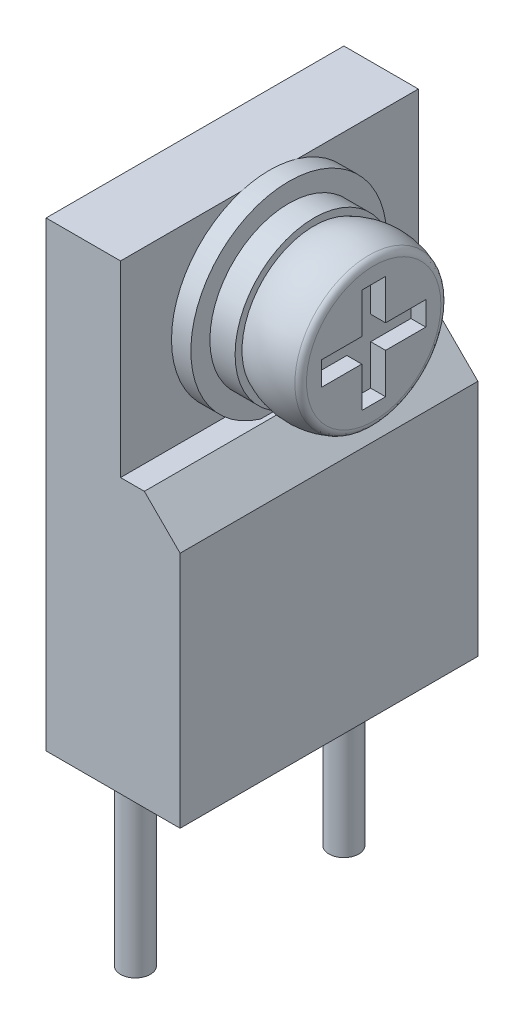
ISO-10303-21;
HEADER;
FILE_DESCRIPTION(('STEP AP214'),'2;1');
FILE_NAME('part.step','',(''),(''),'','','');
FILE_SCHEMA(('AUTOMOTIVE_DESIGN { 1 0 10303 214 1 1 1 1 }'));
ENDSEC;
DATA;
#1=APPLICATION_CONTEXT('core data for automotive mechanical design processes');
#2=APPLICATION_PROTOCOL_DEFINITION('international standard','automotive_design',2000,#1);
#3=PRODUCT_CONTEXT('',#1,'mechanical');
#4=PRODUCT('Part','Part','',(#3));
#5=PRODUCT_RELATED_PRODUCT_CATEGORY('part','',(#4));
#6=PRODUCT_DEFINITION_FORMATION('','',#4);
#7=PRODUCT_DEFINITION_CONTEXT('part definition',#1,'design');
#8=PRODUCT_DEFINITION('design','',#6,#7);
#9=PRODUCT_DEFINITION_SHAPE('','',#8);
#10=(LENGTH_UNIT() NAMED_UNIT(*) SI_UNIT(.MILLI.,.METRE.));
#11=(NAMED_UNIT(*) PLANE_ANGLE_UNIT() SI_UNIT($,.RADIAN.));
#12=(NAMED_UNIT(*) SI_UNIT($,.STERADIAN.) SOLID_ANGLE_UNIT());
#13=UNCERTAINTY_MEASURE_WITH_UNIT(LENGTH_MEASURE(1.E-05),#10,'distance_accuracy_value','');
#14=(GEOMETRIC_REPRESENTATION_CONTEXT(3) GLOBAL_UNCERTAINTY_ASSIGNED_CONTEXT((#13)) GLOBAL_UNIT_ASSIGNED_CONTEXT((#10,
#11,#12)) REPRESENTATION_CONTEXT('',''));
#15=CARTESIAN_POINT('',(0.,0.,0.));
#16=DIRECTION('',(0.,0.,1.));
#17=DIRECTION('',(1.,0.,0.));
#18=AXIS2_PLACEMENT_3D('',#15,#16,#17);
#19=CARTESIAN_POINT('',(1.5,-6.25,-3.5));
#20=DIRECTION('',(0.,1.,0.));
#21=DIRECTION('',(-1.,0.,0.));
#22=AXIS2_PLACEMENT_3D('',#19,#20,#21);
#23=CYLINDRICAL_SURFACE('',#22,0.5);
#24=CARTESIAN_POINT('',(1.5,0.,-3.5));
#25=DIRECTION('',(0.,-1.,0.));
#26=DIRECTION('',(-1.,0.,0.));
#27=AXIS2_PLACEMENT_3D('',#24,#25,#26);
#28=CIRCLE('',#27,0.5);
#29=CARTESIAN_POINT('',(1.,0.,-3.5));
#30=VERTEX_POINT('',#29);
#31=EDGE_CURVE('E11',#30,#30,#28,.T.);
#32=ORIENTED_EDGE('',*,*,#31,.T.);
#33=EDGE_LOOP('',(#32));
#34=FACE_BOUND('',#33,.T.);
#35=CARTESIAN_POINT('',(1.5,-6.25,-3.5));
#36=DIRECTION('',(0.,-1.,0.));
#37=DIRECTION('',(-1.,0.,0.));
#38=AXIS2_PLACEMENT_3D('',#35,#36,#37);
#39=CIRCLE('',#38,0.5);
#40=CARTESIAN_POINT('',(1.,-6.25,-3.5));
#41=VERTEX_POINT('',#40);
#42=EDGE_CURVE('E375',#41,#41,#39,.T.);
#43=ORIENTED_EDGE('',*,*,#42,.F.);
#44=EDGE_LOOP('',(#43));
#45=FACE_BOUND('',#44,.T.);
#46=ADVANCED_FACE('F17',(#34,#45),#23,.T.);
#47=CARTESIAN_POINT('',(1.5,-6.25,3.5));
#48=DIRECTION('',(0.,1.,0.));
#49=DIRECTION('',(-1.,0.,0.));
#50=AXIS2_PLACEMENT_3D('',#47,#48,#49);
#51=CYLINDRICAL_SURFACE('',#50,0.5);
#52=CARTESIAN_POINT('',(1.5,0.,3.5));
#53=DIRECTION('',(0.,-1.,0.));
#54=DIRECTION('',(1.,0.,0.));
#55=AXIS2_PLACEMENT_3D('',#52,#53,#54);
#56=CIRCLE('',#55,0.5);
#57=CARTESIAN_POINT('',(2.,0.,3.5));
#58=VERTEX_POINT('',#57);
#59=EDGE_CURVE('E27',#58,#58,#56,.T.);
#60=ORIENTED_EDGE('',*,*,#59,.T.);
#61=EDGE_LOOP('',(#60));
#62=FACE_BOUND('',#61,.T.);
#63=CARTESIAN_POINT('',(1.5,-6.25,3.5));
#64=DIRECTION('',(0.,-1.,0.));
#65=DIRECTION('',(1.,0.,0.));
#66=AXIS2_PLACEMENT_3D('',#63,#64,#65);
#67=CIRCLE('',#66,0.5);
#68=CARTESIAN_POINT('',(2.,-6.25,3.5));
#69=VERTEX_POINT('',#68);
#70=EDGE_CURVE('E202',#69,#69,#67,.T.);
#71=ORIENTED_EDGE('',*,*,#70,.F.);
#72=EDGE_LOOP('',(#71));
#73=FACE_BOUND('',#72,.T.);
#74=ADVANCED_FACE('F382',(#62,#73),#51,.T.);
#75=CARTESIAN_POINT('',(2.5,12.35,0.));
#76=DIRECTION('',(1.,0.,0.));
#77=DIRECTION('',(0.,0.,-1.));
#78=AXIS2_PLACEMENT_3D('',#75,#76,#77);
#79=CYLINDRICAL_SURFACE('',#78,3.28896076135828);
#80=CARTESIAN_POINT('',(2.5,12.35,0.));
#81=DIRECTION('',(1.,0.,0.));
#82=DIRECTION('',(0.,0.,-1.));
#83=AXIS2_PLACEMENT_3D('',#80,#81,#82);
#84=CIRCLE('',#83,3.28896076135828);
#85=CARTESIAN_POINT('',(2.5,15.5,0.94591907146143));
#86=VERTEX_POINT('',#85);
#87=CARTESIAN_POINT('',(2.5,9.2,0.94591907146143));
#88=VERTEX_POINT('',#87);
#89=EDGE_CURVE('E369',#86,#88,#84,.T.);
#90=ORIENTED_EDGE('',*,*,#89,.T.);
#91=DIRECTION('',(1.,0.,0.));
#92=VECTOR('',#91,1.);
#93=CARTESIAN_POINT('',(2.5,9.2,0.94591907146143));
#94=LINE('',#93,#92);
#95=CARTESIAN_POINT('',(3.15,9.2,0.94591907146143));
#96=VERTEX_POINT('',#95);
#97=EDGE_CURVE('E293',#88,#96,#94,.T.);
#98=ORIENTED_EDGE('',*,*,#97,.T.);
#99=CARTESIAN_POINT('',(3.15,12.35,0.));
#100=DIRECTION('',(1.,0.,0.));
#101=DIRECTION('',(0.,0.,-1.));
#102=AXIS2_PLACEMENT_3D('',#99,#100,#101);
#103=CIRCLE('',#102,3.28896076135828);
#104=CARTESIAN_POINT('',(3.15,9.2,-0.94591907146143));
#105=VERTEX_POINT('',#104);
#106=EDGE_CURVE('E292',#105,#96,#103,.T.);
#107=ORIENTED_EDGE('',*,*,#106,.F.);
#108=DIRECTION('',(-1.,0.,0.));
#109=VECTOR('',#108,1.);
#110=CARTESIAN_POINT('',(2.5,9.2,-0.94591907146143));
#111=LINE('',#110,#109);
#112=CARTESIAN_POINT('',(2.5,9.2,-0.94591907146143));
#113=VERTEX_POINT('',#112);
#114=EDGE_CURVE('E360',#105,#113,#111,.T.);
#115=ORIENTED_EDGE('',*,*,#114,.T.);
#116=CARTESIAN_POINT('',(2.5,12.35,0.));
#117=DIRECTION('',(1.,0.,0.));
#118=DIRECTION('',(0.,0.,-1.));
#119=AXIS2_PLACEMENT_3D('',#116,#117,#118);
#120=CIRCLE('',#119,3.28896076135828);
#121=CARTESIAN_POINT('',(2.5,15.5,-0.94591907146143));
#122=VERTEX_POINT('',#121);
#123=EDGE_CURVE('E366',#113,#122,#120,.T.);
#124=ORIENTED_EDGE('',*,*,#123,.T.);
#125=CARTESIAN_POINT('',(2.5,12.35,0.));
#126=DIRECTION('',(1.,0.,0.));
#127=DIRECTION('',(0.,0.,-1.));
#128=AXIS2_PLACEMENT_3D('',#125,#126,#127);
#129=CIRCLE('',#128,3.28896076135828);
#130=EDGE_CURVE('E363',#122,#86,#129,.T.);
#131=ORIENTED_EDGE('',*,*,#130,.T.);
#132=EDGE_LOOP('',(#90,#98,#107,#115,#124,#131));
#133=FACE_BOUND('',#132,.T.);
#134=ADVANCED_FACE('F389',(#133),#79,.T.);
#135=CARTESIAN_POINT('',(2.5,12.35,0.));
#136=DIRECTION('',(1.,0.,0.));
#137=DIRECTION('',(0.,0.,-1.));
#138=AXIS2_PLACEMENT_3D('',#135,#136,#137);
#139=CYLINDRICAL_SURFACE('',#138,2.65);
#140=CARTESIAN_POINT('',(3.99611740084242,12.35,0.));
#141=DIRECTION('',(1.,0.,0.));
#142=DIRECTION('',(0.,0.,-1.));
#143=AXIS2_PLACEMENT_3D('',#140,#141,#142);
#144=CIRCLE('',#143,2.65);
#145=CARTESIAN_POINT('',(3.99611740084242,12.35,-2.65));
#146=VERTEX_POINT('',#145);
#147=EDGE_CURVE('E349',#146,#146,#144,.T.);
#148=ORIENTED_EDGE('',*,*,#147,.F.);
#149=EDGE_LOOP('',(#148));
#150=FACE_BOUND('',#149,.T.);
#151=CARTESIAN_POINT('',(3.15,12.35,0.));
#152=DIRECTION('',(1.,0.,0.));
#153=DIRECTION('',(0.,0.,-1.));
#154=AXIS2_PLACEMENT_3D('',#151,#152,#153);
#155=CIRCLE('',#154,2.65);
#156=CARTESIAN_POINT('',(3.15,12.35,-2.65));
#157=VERTEX_POINT('',#156);
#158=EDGE_CURVE('E355',#157,#157,#155,.T.);
#159=ORIENTED_EDGE('',*,*,#158,.T.);
#160=EDGE_LOOP('',(#159));
#161=FACE_BOUND('',#160,.T.);
#162=ADVANCED_FACE('F395',(#150,#161),#139,.T.);
#163=CARTESIAN_POINT('',(5.,12.35,0.));
#164=DIRECTION('',(1.,0.,0.));
#165=DIRECTION('',(0.,0.,-1.));
#166=AXIS2_PLACEMENT_3D('',#163,#164,#165);
#167=DEGENERATE_TOROIDAL_SURFACE('',#166,0.363402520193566,2.28659747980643,.T.);
#168=CARTESIAN_POINT('',(5.84206532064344,12.35,0.));
#169=DIRECTION('',(1.,0.,0.));
#170=DIRECTION('',(0.,0.,-1.));
#171=AXIS2_PLACEMENT_3D('',#168,#169,#170);
#172=CIRCLE('',#171,2.48930327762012);
#173=CARTESIAN_POINT('',(5.84206532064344,12.35,-2.48930327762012));
#174=VERTEX_POINT('',#173);
#175=EDGE_CURVE('E343',#174,#174,#172,.T.);
#176=ORIENTED_EDGE('',*,*,#175,.F.);
#177=EDGE_LOOP('',(#176));
#178=FACE_BOUND('',#177,.T.);
#179=CARTESIAN_POINT('',(3.99611740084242,12.35,0.));
#180=DIRECTION('',(1.,0.,0.));
#181=DIRECTION('',(0.,0.,-1.));
#182=AXIS2_PLACEMENT_3D('',#179,#180,#181);
#183=CIRCLE('',#182,2.41784837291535);
#184=CARTESIAN_POINT('',(3.99611740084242,12.35,-2.41784837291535));
#185=VERTEX_POINT('',#184);
#186=EDGE_CURVE('E352',#185,#185,#183,.T.);
#187=ORIENTED_EDGE('',*,*,#186,.T.);
#188=EDGE_LOOP('',(#187));
#189=FACE_BOUND('',#188,.T.);
#190=ADVANCED_FACE('F399',(#178,#189),#167,.T.);
#191=CARTESIAN_POINT('',(5.75,12.35,0.));
#192=DIRECTION('',(1.,0.,0.));
#193=DIRECTION('',(0.,0.,-1.));
#194=AXIS2_PLACEMENT_3D('',#191,#192,#193);
#195=TOROIDAL_SURFACE('',#194,2.25687269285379,0.250000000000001);
#196=CARTESIAN_POINT('',(6.,12.35,0.));
#197=DIRECTION('',(1.,0.,0.));
#198=DIRECTION('',(0.,0.,-1.));
#199=AXIS2_PLACEMENT_3D('',#196,#197,#198);
#200=CIRCLE('',#199,2.25687269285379);
#201=CARTESIAN_POINT('',(6.,12.35,-2.25687269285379));
#202=VERTEX_POINT('',#201);
#203=EDGE_CURVE('E331',#202,#202,#200,.T.);
#204=ORIENTED_EDGE('',*,*,#203,.F.);
#205=EDGE_LOOP('',(#204));
#206=FACE_BOUND('',#205,.T.);
#207=ORIENTED_EDGE('',*,*,#175,.T.);
#208=EDGE_LOOP('',(#207));
#209=FACE_BOUND('',#208,.T.);
#210=ADVANCED_FACE('F403',(#206,#209),#195,.T.);
#211=CARTESIAN_POINT('',(4.5,0.,-5.));
#212=DIRECTION('',(0.,-1.,0.));
#213=DIRECTION('',(1.,0.,0.));
#214=AXIS2_PLACEMENT_3D('',#211,#212,#213);
#215=PLANE('',#214);
#216=ORIENTED_EDGE('',*,*,#59,.F.);
#217=EDGE_LOOP('',(#216));
#218=FACE_BOUND('',#217,.T.);
#219=DIRECTION('',(1.,0.,0.));
#220=VECTOR('',#219,1.);
#221=CARTESIAN_POINT('',(4.5,0.,5.));
#222=LINE('',#221,#220);
#223=CARTESIAN_POINT('',(0.,0.,5.));
#224=VERTEX_POINT('',#223);
#225=CARTESIAN_POINT('',(4.5,0.,5.));
#226=VERTEX_POINT('',#225);
#227=EDGE_CURVE('E278',#224,#226,#222,.T.);
#228=ORIENTED_EDGE('',*,*,#227,.F.);
#229=DIRECTION('',(0.,0.,1.));
#230=VECTOR('',#229,1.);
#231=CARTESIAN_POINT('',(0.,0.,-5.));
#232=LINE('',#231,#230);
#233=CARTESIAN_POINT('',(0.,0.,-5.));
#234=VERTEX_POINT('',#233);
#235=EDGE_CURVE('E315',#234,#224,#232,.T.);
#236=ORIENTED_EDGE('',*,*,#235,.F.);
#237=DIRECTION('',(1.,0.,0.));
#238=VECTOR('',#237,1.);
#239=CARTESIAN_POINT('',(4.5,0.,-5.));
#240=LINE('',#239,#238);
#241=CARTESIAN_POINT('',(4.5,0.,-5.));
#242=VERTEX_POINT('',#241);
#243=EDGE_CURVE('E340',#234,#242,#240,.T.);
#244=ORIENTED_EDGE('',*,*,#243,.T.);
#245=DIRECTION('',(0.,0.,1.));
#246=VECTOR('',#245,1.);
#247=CARTESIAN_POINT('',(4.5,0.,-5.));
#248=LINE('',#247,#246);
#249=EDGE_CURVE('E337',#242,#226,#248,.T.);
#250=ORIENTED_EDGE('',*,*,#249,.T.);
#251=EDGE_LOOP('',(#228,#236,#244,#250));
#252=FACE_BOUND('',#251,.T.);
#253=ORIENTED_EDGE('',*,*,#31,.F.);
#254=EDGE_LOOP('',(#253));
#255=FACE_BOUND('',#254,.T.);
#256=ADVANCED_FACE('F407',(#218,#252,#255),#215,.T.);
#257=CARTESIAN_POINT('',(2.5,15.5,-5.));
#258=DIRECTION('',(1.,0.,0.));
#259=DIRECTION('',(0.,1.,0.));
#260=AXIS2_PLACEMENT_3D('',#257,#258,#259);
#261=PLANE('',#260);
#262=ORIENTED_EDGE('',*,*,#89,.F.);
#263=DIRECTION('',(0.,0.,1.));
#264=VECTOR('',#263,1.);
#265=CARTESIAN_POINT('',(2.5,15.5,-5.));
#266=LINE('',#265,#264);
#267=CARTESIAN_POINT('',(2.5,15.5,5.));
#268=VERTEX_POINT('',#267);
#269=EDGE_CURVE('E326',#86,#268,#266,.T.);
#270=ORIENTED_EDGE('',*,*,#269,.T.);
#271=DIRECTION('',(0.,1.,0.));
#272=VECTOR('',#271,1.);
#273=CARTESIAN_POINT('',(2.5,15.5,5.));
#274=LINE('',#273,#272);
#275=CARTESIAN_POINT('',(2.5,9.2,5.));
#276=VERTEX_POINT('',#275);
#277=EDGE_CURVE('E302',#276,#268,#274,.T.);
#278=ORIENTED_EDGE('',*,*,#277,.F.);
#279=DIRECTION('',(0.,0.,1.));
#280=VECTOR('',#279,1.);
#281=CARTESIAN_POINT('',(2.5,9.2,-5.));
#282=LINE('',#281,#280);
#283=EDGE_CURVE('E297',#88,#276,#282,.T.);
#284=ORIENTED_EDGE('',*,*,#283,.F.);
#285=EDGE_LOOP('',(#262,#270,#278,#284));
#286=FACE_BOUND('',#285,.T.);
#287=ADVANCED_FACE('F411',(#286),#261,.T.);
#288=CARTESIAN_POINT('',(0.,0.,-5.));
#289=DIRECTION('',(-1.,0.,0.));
#290=DIRECTION('',(0.,0.,1.));
#291=AXIS2_PLACEMENT_3D('',#288,#289,#290);
#292=PLANE('',#291);
#293=DIRECTION('',(0.,-1.,0.));
#294=VECTOR('',#293,1.);
#295=CARTESIAN_POINT('',(0.,0.,5.));
#296=LINE('',#295,#294);
#297=CARTESIAN_POINT('',(0.,15.5,5.));
#298=VERTEX_POINT('',#297);
#299=EDGE_CURVE('E322',#298,#224,#296,.T.);
#300=ORIENTED_EDGE('',*,*,#299,.F.);
#301=DIRECTION('',(0.,0.,1.));
#302=VECTOR('',#301,1.);
#303=CARTESIAN_POINT('',(0.,15.5,-5.));
#304=LINE('',#303,#302);
#305=CARTESIAN_POINT('',(0.,15.5,-5.));
#306=VERTEX_POINT('',#305);
#307=EDGE_CURVE('E308',#306,#298,#304,.T.);
#308=ORIENTED_EDGE('',*,*,#307,.F.);
#309=DIRECTION('',(0.,-1.,0.));
#310=VECTOR('',#309,1.);
#311=CARTESIAN_POINT('',(0.,0.,-5.));
#312=LINE('',#311,#310);
#313=EDGE_CURVE('E323',#306,#234,#312,.T.);
#314=ORIENTED_EDGE('',*,*,#313,.T.);
#315=ORIENTED_EDGE('',*,*,#235,.T.);
#316=EDGE_LOOP('',(#300,#308,#314,#315));
#317=FACE_BOUND('',#316,.T.);
#318=ADVANCED_FACE('F415',(#317),#292,.T.);
#319=CARTESIAN_POINT('',(0.,15.5,-5.));
#320=DIRECTION('',(0.,1.,0.));
#321=DIRECTION('',(0.,0.,1.));
#322=AXIS2_PLACEMENT_3D('',#319,#320,#321);
#323=PLANE('',#322);
#324=DIRECTION('',(-1.,0.,0.));
#325=VECTOR('',#324,1.);
#326=CARTESIAN_POINT('',(0.,15.5,5.));
#327=LINE('',#326,#325);
#328=EDGE_CURVE('E319',#268,#298,#327,.T.);
#329=ORIENTED_EDGE('',*,*,#328,.F.);
#330=ORIENTED_EDGE('',*,*,#269,.F.);
#331=DIRECTION('',(0.,0.,1.));
#332=VECTOR('',#331,1.);
#333=CARTESIAN_POINT('',(2.5,15.5,-5.));
#334=LINE('',#333,#332);
#335=EDGE_CURVE('E36',#122,#86,#334,.T.);
#336=ORIENTED_EDGE('',*,*,#335,.F.);
#337=DIRECTION('',(0.,0.,1.));
#338=VECTOR('',#337,1.);
#339=CARTESIAN_POINT('',(2.5,15.5,-5.));
#340=LINE('',#339,#338);
#341=CARTESIAN_POINT('',(2.5,15.5,-5.));
#342=VERTEX_POINT('',#341);
#343=EDGE_CURVE('E309',#342,#122,#340,.T.);
#344=ORIENTED_EDGE('',*,*,#343,.F.);
#345=DIRECTION('',(-1.,0.,0.));
#346=VECTOR('',#345,1.);
#347=CARTESIAN_POINT('',(0.,15.5,-5.));
#348=LINE('',#347,#346);
#349=EDGE_CURVE('E312',#342,#306,#348,.T.);
#350=ORIENTED_EDGE('',*,*,#349,.T.);
#351=ORIENTED_EDGE('',*,*,#307,.T.);
#352=EDGE_LOOP('',(#329,#330,#336,#344,#350,#351));
#353=FACE_BOUND('',#352,.T.);
#354=ADVANCED_FACE('F419',(#353),#323,.T.);
#355=CARTESIAN_POINT('',(2.5,15.5,-5.));
#356=DIRECTION('',(1.,0.,0.));
#357=DIRECTION('',(0.,1.,0.));
#358=AXIS2_PLACEMENT_3D('',#355,#356,#357);
#359=PLANE('',#358);
#360=ORIENTED_EDGE('',*,*,#123,.F.);
#361=DIRECTION('',(0.,0.,1.));
#362=VECTOR('',#361,1.);
#363=CARTESIAN_POINT('',(2.5,9.2,-5.));
#364=LINE('',#363,#362);
#365=CARTESIAN_POINT('',(2.5,9.2,-5.));
#366=VERTEX_POINT('',#365);
#367=EDGE_CURVE('E283',#366,#113,#364,.T.);
#368=ORIENTED_EDGE('',*,*,#367,.F.);
#369=DIRECTION('',(0.,1.,0.));
#370=VECTOR('',#369,1.);
#371=CARTESIAN_POINT('',(2.5,15.5,-5.));
#372=LINE('',#371,#370);
#373=EDGE_CURVE('E305',#366,#342,#372,.T.);
#374=ORIENTED_EDGE('',*,*,#373,.T.);
#375=ORIENTED_EDGE('',*,*,#343,.T.);
#376=EDGE_LOOP('',(#360,#368,#374,#375));
#377=FACE_BOUND('',#376,.T.);
#378=ADVANCED_FACE('F423',(#377),#359,.T.);
#379=CARTESIAN_POINT('',(2.5,9.2,-5.));
#380=DIRECTION('',(0.,1.,0.));
#381=DIRECTION('',(0.,0.,1.));
#382=AXIS2_PLACEMENT_3D('',#379,#380,#381);
#383=PLANE('',#382);
#384=ORIENTED_EDGE('',*,*,#97,.F.);
#385=ORIENTED_EDGE('',*,*,#283,.T.);
#386=DIRECTION('',(-1.,0.,0.));
#387=VECTOR('',#386,1.);
#388=CARTESIAN_POINT('',(2.5,9.2,5.));
#389=LINE('',#388,#387);
#390=CARTESIAN_POINT('',(3.3,9.2,5.));
#391=VERTEX_POINT('',#390);
#392=EDGE_CURVE('E288',#391,#276,#389,.T.);
#393=ORIENTED_EDGE('',*,*,#392,.F.);
#394=DIRECTION('',(0.,0.,1.));
#395=VECTOR('',#394,1.);
#396=CARTESIAN_POINT('',(3.3,9.2,-5.));
#397=LINE('',#396,#395);
#398=CARTESIAN_POINT('',(3.3,9.2,-5.));
#399=VERTEX_POINT('',#398);
#400=EDGE_CURVE('E273',#399,#391,#397,.T.);
#401=ORIENTED_EDGE('',*,*,#400,.F.);
#402=DIRECTION('',(-1.,0.,0.));
#403=VECTOR('',#402,1.);
#404=CARTESIAN_POINT('',(2.5,9.2,-5.));
#405=LINE('',#404,#403);
#406=EDGE_CURVE('E294',#399,#366,#405,.T.);
#407=ORIENTED_EDGE('',*,*,#406,.T.);
#408=ORIENTED_EDGE('',*,*,#367,.T.);
#409=ORIENTED_EDGE('',*,*,#114,.F.);
#410=DIRECTION('',(0.,0.,-1.));
#411=VECTOR('',#410,1.);
#412=CARTESIAN_POINT('',(3.15,9.2,-5.));
#413=LINE('',#412,#411);
#414=EDGE_CURVE('E289',#96,#105,#413,.T.);
#415=ORIENTED_EDGE('',*,*,#414,.F.);
#416=EDGE_LOOP('',(#384,#385,#393,#401,#407,#408,#409,#415));
#417=FACE_BOUND('',#416,.T.);
#418=ADVANCED_FACE('F426',(#417),#383,.T.);
#419=CARTESIAN_POINT('',(3.3,9.2,-5.));
#420=DIRECTION('',(0.707106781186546,0.707106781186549,0.));
#421=DIRECTION('',(-0.707106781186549,0.707106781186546,0.));
#422=AXIS2_PLACEMENT_3D('',#419,#420,#421);
#423=PLANE('',#422);
#424=DIRECTION('',(-0.707106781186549,0.707106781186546,0.));
#425=VECTOR('',#424,1.);
#426=CARTESIAN_POINT('',(3.3,9.2,5.));
#427=LINE('',#426,#425);
#428=CARTESIAN_POINT('',(4.5,8.,5.));
#429=VERTEX_POINT('',#428);
#430=EDGE_CURVE('E279',#429,#391,#427,.T.);
#431=ORIENTED_EDGE('',*,*,#430,.F.);
#432=DIRECTION('',(0.,0.,1.));
#433=VECTOR('',#432,1.);
#434=CARTESIAN_POINT('',(4.5,8.,-5.));
#435=LINE('',#434,#433);
#436=CARTESIAN_POINT('',(4.5,8.,-5.));
#437=VERTEX_POINT('',#436);
#438=EDGE_CURVE('E274',#437,#429,#435,.T.);
#439=ORIENTED_EDGE('',*,*,#438,.F.);
#440=DIRECTION('',(-0.707106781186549,0.707106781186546,0.));
#441=VECTOR('',#440,1.);
#442=CARTESIAN_POINT('',(3.3,9.2,-5.));
#443=LINE('',#442,#441);
#444=EDGE_CURVE('E280',#437,#399,#443,.T.);
#445=ORIENTED_EDGE('',*,*,#444,.T.);
#446=ORIENTED_EDGE('',*,*,#400,.T.);
#447=EDGE_LOOP('',(#431,#439,#445,#446));
#448=FACE_BOUND('',#447,.T.);
#449=ADVANCED_FACE('F430',(#448),#423,.T.);
#450=CARTESIAN_POINT('',(4.5,8.,-5.));
#451=DIRECTION('',(1.,0.,0.));
#452=DIRECTION('',(0.,1.,0.));
#453=AXIS2_PLACEMENT_3D('',#450,#451,#452);
#454=PLANE('',#453);
#455=DIRECTION('',(0.,1.,0.));
#456=VECTOR('',#455,1.);
#457=CARTESIAN_POINT('',(4.5,8.,5.));
#458=LINE('',#457,#456);
#459=EDGE_CURVE('E275',#226,#429,#458,.T.);
#460=ORIENTED_EDGE('',*,*,#459,.F.);
#461=ORIENTED_EDGE('',*,*,#249,.F.);
#462=DIRECTION('',(0.,1.,0.));
#463=VECTOR('',#462,1.);
#464=CARTESIAN_POINT('',(4.5,8.,-5.));
#465=LINE('',#464,#463);
#466=EDGE_CURVE('E270',#242,#437,#465,.T.);
#467=ORIENTED_EDGE('',*,*,#466,.T.);
#468=ORIENTED_EDGE('',*,*,#438,.T.);
#469=EDGE_LOOP('',(#460,#461,#467,#468));
#470=FACE_BOUND('',#469,.T.);
#471=ADVANCED_FACE('F434',(#470),#454,.T.);
#472=CARTESIAN_POINT('',(0.,0.,-5.));
#473=DIRECTION('',(0.,0.,-1.));
#474=DIRECTION('',(-1.,0.,0.));
#475=AXIS2_PLACEMENT_3D('',#472,#473,#474);
#476=PLANE('',#475);
#477=ORIENTED_EDGE('',*,*,#243,.F.);
#478=ORIENTED_EDGE('',*,*,#313,.F.);
#479=ORIENTED_EDGE('',*,*,#349,.F.);
#480=ORIENTED_EDGE('',*,*,#373,.F.);
#481=ORIENTED_EDGE('',*,*,#406,.F.);
#482=ORIENTED_EDGE('',*,*,#444,.F.);
#483=ORIENTED_EDGE('',*,*,#466,.F.);
#484=EDGE_LOOP('',(#477,#478,#479,#480,#481,#482,#483));
#485=FACE_BOUND('',#484,.T.);
#486=ADVANCED_FACE('F438',(#485),#476,.T.);
#487=CARTESIAN_POINT('',(0.,0.,5.));
#488=DIRECTION('',(0.,0.,-1.));
#489=DIRECTION('',(-1.,0.,0.));
#490=AXIS2_PLACEMENT_3D('',#487,#488,#489);
#491=PLANE('',#490);
#492=ORIENTED_EDGE('',*,*,#227,.T.);
#493=ORIENTED_EDGE('',*,*,#459,.T.);
#494=ORIENTED_EDGE('',*,*,#430,.T.);
#495=ORIENTED_EDGE('',*,*,#392,.T.);
#496=ORIENTED_EDGE('',*,*,#277,.T.);
#497=ORIENTED_EDGE('',*,*,#328,.T.);
#498=ORIENTED_EDGE('',*,*,#299,.T.);
#499=EDGE_LOOP('',(#492,#493,#494,#495,#496,#497,#498));
#500=FACE_BOUND('',#499,.T.);
#501=ADVANCED_FACE('F442',(#500),#491,.F.);
#502=CARTESIAN_POINT('',(6.,14.6068726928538,0.));
#503=DIRECTION('',(1.,0.,0.));
#504=DIRECTION('',(0.,0.,-1.));
#505=AXIS2_PLACEMENT_3D('',#502,#503,#504);
#506=PLANE('',#505);
#507=DIRECTION('',(0.,-1.,0.));
#508=VECTOR('',#507,1.);
#509=CARTESIAN_POINT('',(6.,14.1,0.4));
#510=LINE('',#509,#508);
#511=CARTESIAN_POINT('',(6.,14.1,0.4));
#512=VERTEX_POINT('',#511);
#513=CARTESIAN_POINT('',(6.,12.75,0.4));
#514=VERTEX_POINT('',#513);
#515=EDGE_CURVE('E197',#512,#514,#510,.T.);
#516=ORIENTED_EDGE('',*,*,#515,.F.);
#517=DIRECTION('',(0.,0.,1.));
#518=VECTOR('',#517,1.);
#519=CARTESIAN_POINT('',(6.,14.1,0.4));
#520=LINE('',#519,#518);
#521=CARTESIAN_POINT('',(6.,14.1,-0.4));
#522=VERTEX_POINT('',#521);
#523=EDGE_CURVE('E198',#522,#512,#520,.T.);
#524=ORIENTED_EDGE('',*,*,#523,.F.);
#525=DIRECTION('',(0.,1.,0.));
#526=VECTOR('',#525,1.);
#527=CARTESIAN_POINT('',(6.,14.1,-0.4));
#528=LINE('',#527,#526);
#529=CARTESIAN_POINT('',(6.,12.75,-0.4));
#530=VERTEX_POINT('',#529);
#531=EDGE_CURVE('E206',#530,#522,#528,.T.);
#532=ORIENTED_EDGE('',*,*,#531,.F.);
#533=DIRECTION('',(0.,0.,1.));
#534=VECTOR('',#533,1.);
#535=CARTESIAN_POINT('',(6.,12.75,-0.4));
#536=LINE('',#535,#534);
#537=CARTESIAN_POINT('',(6.,12.75,-1.75));
#538=VERTEX_POINT('',#537);
#539=EDGE_CURVE('E213',#538,#530,#536,.T.);
#540=ORIENTED_EDGE('',*,*,#539,.F.);
#541=DIRECTION('',(0.,1.,0.));
#542=VECTOR('',#541,1.);
#543=CARTESIAN_POINT('',(6.,12.75,-1.75));
#544=LINE('',#543,#542);
#545=CARTESIAN_POINT('',(6.,11.95,-1.75));
#546=VERTEX_POINT('',#545);
#547=EDGE_CURVE('E220',#546,#538,#544,.T.);
#548=ORIENTED_EDGE('',*,*,#547,.F.);
#549=DIRECTION('',(0.,0.,-1.));
#550=VECTOR('',#549,1.);
#551=CARTESIAN_POINT('',(6.,11.95,-0.4));
#552=LINE('',#551,#550);
#553=CARTESIAN_POINT('',(6.,11.95,-0.4));
#554=VERTEX_POINT('',#553);
#555=EDGE_CURVE('E227',#554,#546,#552,.T.);
#556=ORIENTED_EDGE('',*,*,#555,.F.);
#557=DIRECTION('',(0.,1.,0.));
#558=VECTOR('',#557,1.);
#559=CARTESIAN_POINT('',(6.,11.95,-0.4));
#560=LINE('',#559,#558);
#561=CARTESIAN_POINT('',(6.,10.6,-0.400000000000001));
#562=VERTEX_POINT('',#561);
#563=EDGE_CURVE('E234',#562,#554,#560,.T.);
#564=ORIENTED_EDGE('',*,*,#563,.F.);
#565=DIRECTION('',(0.,0.,-1.));
#566=VECTOR('',#565,1.);
#567=CARTESIAN_POINT('',(6.,10.6,0.4));
#568=LINE('',#567,#566);
#569=CARTESIAN_POINT('',(6.,10.6,0.4));
#570=VERTEX_POINT('',#569);
#571=EDGE_CURVE('E241',#570,#562,#568,.T.);
#572=ORIENTED_EDGE('',*,*,#571,.F.);
#573=DIRECTION('',(0.,-1.,0.));
#574=VECTOR('',#573,1.);
#575=CARTESIAN_POINT('',(6.,11.95,0.4));
#576=LINE('',#575,#574);
#577=CARTESIAN_POINT('',(6.,11.95,0.4));
#578=VERTEX_POINT('',#577);
#579=EDGE_CURVE('E248',#578,#570,#576,.T.);
#580=ORIENTED_EDGE('',*,*,#579,.F.);
#581=DIRECTION('',(0.,0.,-1.));
#582=VECTOR('',#581,1.);
#583=CARTESIAN_POINT('',(6.,11.95,1.75));
#584=LINE('',#583,#582);
#585=CARTESIAN_POINT('',(6.,11.95,1.75));
#586=VERTEX_POINT('',#585);
#587=EDGE_CURVE('E254',#586,#578,#584,.T.);
#588=ORIENTED_EDGE('',*,*,#587,.F.);
#589=DIRECTION('',(0.,-1.,0.));
#590=VECTOR('',#589,1.);
#591=CARTESIAN_POINT('',(6.,12.75,1.75));
#592=LINE('',#591,#590);
#593=CARTESIAN_POINT('',(6.,12.75,1.75));
#594=VERTEX_POINT('',#593);
#595=EDGE_CURVE('E184',#594,#586,#592,.T.);
#596=ORIENTED_EDGE('',*,*,#595,.F.);
#597=DIRECTION('',(0.,0.,1.));
#598=VECTOR('',#597,1.);
#599=CARTESIAN_POINT('',(6.,12.75,1.75));
#600=LINE('',#599,#598);
#601=EDGE_CURVE('E182',#514,#594,#600,.T.);
#602=ORIENTED_EDGE('',*,*,#601,.F.);
#603=EDGE_LOOP('',(#516,#524,#532,#540,#548,#556,#564,#572,#580,#588,#596,#602));
#604=FACE_BOUND('',#603,.T.);
#605=ORIENTED_EDGE('',*,*,#203,.T.);
#606=EDGE_LOOP('',(#605));
#607=FACE_BOUND('',#606,.T.);
#608=ADVANCED_FACE('F446',(#604,#607),#506,.T.);
#609=CARTESIAN_POINT('',(3.99611740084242,14.7678483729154,0.));
#610=DIRECTION('',(1.,0.,0.));
#611=DIRECTION('',(0.,0.,-1.));
#612=AXIS2_PLACEMENT_3D('',#609,#610,#611);
#613=PLANE('',#612);
#614=ORIENTED_EDGE('',*,*,#147,.T.);
#615=EDGE_LOOP('',(#614));
#616=FACE_BOUND('',#615,.T.);
#617=ORIENTED_EDGE('',*,*,#186,.F.);
#618=EDGE_LOOP('',(#617));
#619=FACE_BOUND('',#618,.T.);
#620=ADVANCED_FACE('F450',(#616,#619),#613,.T.);
#621=CARTESIAN_POINT('',(3.15,15.6389607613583,0.));
#622=DIRECTION('',(1.,0.,0.));
#623=DIRECTION('',(0.,0.,-1.));
#624=AXIS2_PLACEMENT_3D('',#621,#622,#623);
#625=PLANE('',#624);
#626=ORIENTED_EDGE('',*,*,#414,.T.);
#627=ORIENTED_EDGE('',*,*,#106,.T.);
#628=EDGE_LOOP('',(#626,#627));
#629=FACE_BOUND('',#628,.T.);
#630=ORIENTED_EDGE('',*,*,#158,.F.);
#631=EDGE_LOOP('',(#630));
#632=FACE_BOUND('',#631,.T.);
#633=ADVANCED_FACE('F454',(#629,#632),#625,.T.);
#634=CARTESIAN_POINT('',(2.5,12.35,0.));
#635=DIRECTION('',(-1.,0.,0.));
#636=DIRECTION('',(0.,0.,1.));
#637=AXIS2_PLACEMENT_3D('',#634,#635,#636);
#638=PLANE('',#637);
#639=ORIENTED_EDGE('',*,*,#130,.F.);
#640=ORIENTED_EDGE('',*,*,#335,.T.);
#641=EDGE_LOOP('',(#639,#640));
#642=FACE_BOUND('',#641,.T.);
#643=ADVANCED_FACE('F458',(#642),#638,.T.);
#644=CARTESIAN_POINT('',(5.5,14.1,0.4));
#645=DIRECTION('',(0.,0.,1.));
#646=DIRECTION('',(0.,-1.,0.));
#647=AXIS2_PLACEMENT_3D('',#644,#645,#646);
#648=PLANE('',#647);
#649=ORIENTED_EDGE('',*,*,#515,.T.);
#650=DIRECTION('',(1.,0.,0.));
#651=VECTOR('',#650,1.);
#652=CARTESIAN_POINT('',(5.5,12.75,0.4));
#653=LINE('',#652,#651);
#654=CARTESIAN_POINT('',(5.5,12.75,0.4));
#655=VERTEX_POINT('',#654);
#656=EDGE_CURVE('E189',#655,#514,#653,.T.);
#657=ORIENTED_EDGE('',*,*,#656,.F.);
#658=DIRECTION('',(0.,-1.,0.));
#659=VECTOR('',#658,1.);
#660=CARTESIAN_POINT('',(5.5,14.1,0.4));
#661=LINE('',#660,#659);
#662=CARTESIAN_POINT('',(5.5,14.1,0.4));
#663=VERTEX_POINT('',#662);
#664=EDGE_CURVE('E187',#663,#655,#661,.T.);
#665=ORIENTED_EDGE('',*,*,#664,.F.);
#666=DIRECTION('',(1.,0.,0.));
#667=VECTOR('',#666,1.);
#668=CARTESIAN_POINT('',(5.5,14.1,0.4));
#669=LINE('',#668,#667);
#670=EDGE_CURVE('E194',#663,#512,#669,.T.);
#671=ORIENTED_EDGE('',*,*,#670,.T.);
#672=EDGE_LOOP('',(#649,#657,#665,#671));
#673=FACE_BOUND('',#672,.T.);
#674=ADVANCED_FACE('F462',(#673),#648,.F.);
#675=CARTESIAN_POINT('',(5.5,14.1,0.4));
#676=DIRECTION('',(0.,1.,0.));
#677=DIRECTION('',(0.,0.,1.));
#678=AXIS2_PLACEMENT_3D('',#675,#676,#677);
#679=PLANE('',#678);
#680=ORIENTED_EDGE('',*,*,#523,.T.);
#681=ORIENTED_EDGE('',*,*,#670,.F.);
#682=DIRECTION('',(0.,0.,1.));
#683=VECTOR('',#682,1.);
#684=CARTESIAN_POINT('',(5.5,14.1,0.4));
#685=LINE('',#684,#683);
#686=CARTESIAN_POINT('',(5.5,14.1,-0.4));
#687=VERTEX_POINT('',#686);
#688=EDGE_CURVE('E199',#687,#663,#685,.T.);
#689=ORIENTED_EDGE('',*,*,#688,.F.);
#690=DIRECTION('',(1.,0.,0.));
#691=VECTOR('',#690,1.);
#692=CARTESIAN_POINT('',(5.5,14.1,-0.4));
#693=LINE('',#692,#691);
#694=EDGE_CURVE('E203',#687,#522,#693,.T.);
#695=ORIENTED_EDGE('',*,*,#694,.T.);
#696=EDGE_LOOP('',(#680,#681,#689,#695));
#697=FACE_BOUND('',#696,.T.);
#698=ADVANCED_FACE('F466',(#697),#679,.F.);
#699=CARTESIAN_POINT('',(5.5,14.1,-0.4));
#700=DIRECTION('',(0.,0.,-1.));
#701=DIRECTION('',(0.,1.,0.));
#702=AXIS2_PLACEMENT_3D('',#699,#700,#701);
#703=PLANE('',#702);
#704=ORIENTED_EDGE('',*,*,#531,.T.);
#705=ORIENTED_EDGE('',*,*,#694,.F.);
#706=DIRECTION('',(0.,1.,0.));
#707=VECTOR('',#706,1.);
#708=CARTESIAN_POINT('',(5.5,14.1,-0.4));
#709=LINE('',#708,#707);
#710=CARTESIAN_POINT('',(5.5,12.75,-0.4));
#711=VERTEX_POINT('',#710);
#712=EDGE_CURVE('E201',#711,#687,#709,.T.);
#713=ORIENTED_EDGE('',*,*,#712,.F.);
#714=DIRECTION('',(1.,0.,0.));
#715=VECTOR('',#714,1.);
#716=CARTESIAN_POINT('',(5.5,12.75,-0.4));
#717=LINE('',#716,#715);
#718=EDGE_CURVE('E210',#711,#530,#717,.T.);
#719=ORIENTED_EDGE('',*,*,#718,.T.);
#720=EDGE_LOOP('',(#704,#705,#713,#719));
#721=FACE_BOUND('',#720,.T.);
#722=ADVANCED_FACE('F470',(#721),#703,.F.);
#723=CARTESIAN_POINT('',(5.5,12.75,-0.4));
#724=DIRECTION('',(0.,1.,0.));
#725=DIRECTION('',(0.,0.,1.));
#726=AXIS2_PLACEMENT_3D('',#723,#724,#725);
#727=PLANE('',#726);
#728=ORIENTED_EDGE('',*,*,#539,.T.);
#729=ORIENTED_EDGE('',*,*,#718,.F.);
#730=DIRECTION('',(0.,0.,1.));
#731=VECTOR('',#730,1.);
#732=CARTESIAN_POINT('',(5.5,12.75,-0.4));
#733=LINE('',#732,#731);
#734=CARTESIAN_POINT('',(5.5,12.75,-1.75));
#735=VERTEX_POINT('',#734);
#736=EDGE_CURVE('E209',#735,#711,#733,.T.);
#737=ORIENTED_EDGE('',*,*,#736,.F.);
#738=DIRECTION('',(1.,0.,0.));
#739=VECTOR('',#738,1.);
#740=CARTESIAN_POINT('',(5.5,12.75,-1.75));
#741=LINE('',#740,#739);
#742=EDGE_CURVE('E217',#735,#538,#741,.T.);
#743=ORIENTED_EDGE('',*,*,#742,.T.);
#744=EDGE_LOOP('',(#728,#729,#737,#743));
#745=FACE_BOUND('',#744,.T.);
#746=ADVANCED_FACE('F474',(#745),#727,.F.);
#747=CARTESIAN_POINT('',(5.5,12.75,-1.75));
#748=DIRECTION('',(0.,0.,-1.));
#749=DIRECTION('',(-1.,0.,0.));
#750=AXIS2_PLACEMENT_3D('',#747,#748,#749);
#751=PLANE('',#750);
#752=ORIENTED_EDGE('',*,*,#547,.T.);
#753=ORIENTED_EDGE('',*,*,#742,.F.);
#754=DIRECTION('',(0.,1.,0.));
#755=VECTOR('',#754,1.);
#756=CARTESIAN_POINT('',(5.5,12.75,-1.75));
#757=LINE('',#756,#755);
#758=CARTESIAN_POINT('',(5.5,11.95,-1.75));
#759=VERTEX_POINT('',#758);
#760=EDGE_CURVE('E216',#759,#735,#757,.T.);
#761=ORIENTED_EDGE('',*,*,#760,.F.);
#762=DIRECTION('',(1.,0.,0.));
#763=VECTOR('',#762,1.);
#764=CARTESIAN_POINT('',(5.5,11.95,-1.75));
#765=LINE('',#764,#763);
#766=EDGE_CURVE('E224',#759,#546,#765,.T.);
#767=ORIENTED_EDGE('',*,*,#766,.T.);
#768=EDGE_LOOP('',(#752,#753,#761,#767));
#769=FACE_BOUND('',#768,.T.);
#770=ADVANCED_FACE('F478',(#769),#751,.F.);
#771=CARTESIAN_POINT('',(5.5,11.95,-0.4));
#772=DIRECTION('',(0.,-1.,0.));
#773=DIRECTION('',(0.,0.,-1.));
#774=AXIS2_PLACEMENT_3D('',#771,#772,#773);
#775=PLANE('',#774);
#776=ORIENTED_EDGE('',*,*,#555,.T.);
#777=ORIENTED_EDGE('',*,*,#766,.F.);
#778=DIRECTION('',(0.,0.,-1.));
#779=VECTOR('',#778,1.);
#780=CARTESIAN_POINT('',(5.5,11.95,-0.4));
#781=LINE('',#780,#779);
#782=CARTESIAN_POINT('',(5.5,11.95,-0.4));
#783=VERTEX_POINT('',#782);
#784=EDGE_CURVE('E223',#783,#759,#781,.T.);
#785=ORIENTED_EDGE('',*,*,#784,.F.);
#786=DIRECTION('',(1.,0.,0.));
#787=VECTOR('',#786,1.);
#788=CARTESIAN_POINT('',(5.5,11.95,-0.4));
#789=LINE('',#788,#787);
#790=EDGE_CURVE('E231',#783,#554,#789,.T.);
#791=ORIENTED_EDGE('',*,*,#790,.T.);
#792=EDGE_LOOP('',(#776,#777,#785,#791));
#793=FACE_BOUND('',#792,.T.);
#794=ADVANCED_FACE('F482',(#793),#775,.F.);
#795=CARTESIAN_POINT('',(5.5,11.95,-0.4));
#796=DIRECTION('',(0.,0.,-1.));
#797=DIRECTION('',(0.,1.,0.));
#798=AXIS2_PLACEMENT_3D('',#795,#796,#797);
#799=PLANE('',#798);
#800=ORIENTED_EDGE('',*,*,#563,.T.);
#801=ORIENTED_EDGE('',*,*,#790,.F.);
#802=DIRECTION('',(0.,1.,0.));
#803=VECTOR('',#802,1.);
#804=CARTESIAN_POINT('',(5.5,11.95,-0.4));
#805=LINE('',#804,#803);
#806=CARTESIAN_POINT('',(5.5,10.6,-0.400000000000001));
#807=VERTEX_POINT('',#806);
#808=EDGE_CURVE('E230',#807,#783,#805,.T.);
#809=ORIENTED_EDGE('',*,*,#808,.F.);
#810=DIRECTION('',(1.,0.,0.));
#811=VECTOR('',#810,1.);
#812=CARTESIAN_POINT('',(5.5,10.6,-0.400000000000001));
#813=LINE('',#812,#811);
#814=EDGE_CURVE('E238',#807,#562,#813,.T.);
#815=ORIENTED_EDGE('',*,*,#814,.T.);
#816=EDGE_LOOP('',(#800,#801,#809,#815));
#817=FACE_BOUND('',#816,.T.);
#818=ADVANCED_FACE('F486',(#817),#799,.F.);
#819=CARTESIAN_POINT('',(5.5,10.6,0.4));
#820=DIRECTION('',(0.,-1.,0.));
#821=DIRECTION('',(0.,0.,-1.));
#822=AXIS2_PLACEMENT_3D('',#819,#820,#821);
#823=PLANE('',#822);
#824=ORIENTED_EDGE('',*,*,#571,.T.);
#825=ORIENTED_EDGE('',*,*,#814,.F.);
#826=DIRECTION('',(0.,0.,-1.));
#827=VECTOR('',#826,1.);
#828=CARTESIAN_POINT('',(5.5,10.6,0.4));
#829=LINE('',#828,#827);
#830=CARTESIAN_POINT('',(5.5,10.6,0.4));
#831=VERTEX_POINT('',#830);
#832=EDGE_CURVE('E237',#831,#807,#829,.T.);
#833=ORIENTED_EDGE('',*,*,#832,.F.);
#834=DIRECTION('',(1.,0.,0.));
#835=VECTOR('',#834,1.);
#836=CARTESIAN_POINT('',(5.5,10.6,0.4));
#837=LINE('',#836,#835);
#838=EDGE_CURVE('E245',#831,#570,#837,.T.);
#839=ORIENTED_EDGE('',*,*,#838,.T.);
#840=EDGE_LOOP('',(#824,#825,#833,#839));
#841=FACE_BOUND('',#840,.T.);
#842=ADVANCED_FACE('F490',(#841),#823,.F.);
#843=CARTESIAN_POINT('',(5.5,11.95,0.4));
#844=DIRECTION('',(0.,0.,1.));
#845=DIRECTION('',(0.,-1.,0.));
#846=AXIS2_PLACEMENT_3D('',#843,#844,#845);
#847=PLANE('',#846);
#848=ORIENTED_EDGE('',*,*,#579,.T.);
#849=ORIENTED_EDGE('',*,*,#838,.F.);
#850=DIRECTION('',(0.,-1.,0.));
#851=VECTOR('',#850,1.);
#852=CARTESIAN_POINT('',(5.5,11.95,0.4));
#853=LINE('',#852,#851);
#854=CARTESIAN_POINT('',(5.5,11.95,0.4));
#855=VERTEX_POINT('',#854);
#856=EDGE_CURVE('E244',#855,#831,#853,.T.);
#857=ORIENTED_EDGE('',*,*,#856,.F.);
#858=DIRECTION('',(1.,0.,0.));
#859=VECTOR('',#858,1.);
#860=CARTESIAN_POINT('',(5.5,11.95,0.4));
#861=LINE('',#860,#859);
#862=EDGE_CURVE('E251',#855,#578,#861,.T.);
#863=ORIENTED_EDGE('',*,*,#862,.T.);
#864=EDGE_LOOP('',(#848,#849,#857,#863));
#865=FACE_BOUND('',#864,.T.);
#866=ADVANCED_FACE('F494',(#865),#847,.F.);
#867=CARTESIAN_POINT('',(5.5,11.95,1.75));
#868=DIRECTION('',(0.,-1.,0.));
#869=DIRECTION('',(0.,0.,-1.));
#870=AXIS2_PLACEMENT_3D('',#867,#868,#869);
#871=PLANE('',#870);
#872=ORIENTED_EDGE('',*,*,#587,.T.);
#873=ORIENTED_EDGE('',*,*,#862,.F.);
#874=DIRECTION('',(0.,0.,-1.));
#875=VECTOR('',#874,1.);
#876=CARTESIAN_POINT('',(5.5,11.95,1.75));
#877=LINE('',#876,#875);
#878=CARTESIAN_POINT('',(5.5,11.95,1.75));
#879=VERTEX_POINT('',#878);
#880=EDGE_CURVE('E164',#879,#855,#877,.T.);
#881=ORIENTED_EDGE('',*,*,#880,.F.);
#882=DIRECTION('',(1.,0.,0.));
#883=VECTOR('',#882,1.);
#884=CARTESIAN_POINT('',(5.5,11.95,1.75));
#885=LINE('',#884,#883);
#886=EDGE_CURVE('E174',#879,#586,#885,.T.);
#887=ORIENTED_EDGE('',*,*,#886,.T.);
#888=EDGE_LOOP('',(#872,#873,#881,#887));
#889=FACE_BOUND('',#888,.T.);
#890=ADVANCED_FACE('F498',(#889),#871,.F.);
#891=CARTESIAN_POINT('',(5.5,12.75,1.75));
#892=DIRECTION('',(0.,0.,1.));
#893=DIRECTION('',(1.,0.,0.));
#894=AXIS2_PLACEMENT_3D('',#891,#892,#893);
#895=PLANE('',#894);
#896=ORIENTED_EDGE('',*,*,#595,.T.);
#897=ORIENTED_EDGE('',*,*,#886,.F.);
#898=DIRECTION('',(0.,-1.,0.));
#899=VECTOR('',#898,1.);
#900=CARTESIAN_POINT('',(5.5,12.75,1.75));
#901=LINE('',#900,#899);
#902=CARTESIAN_POINT('',(5.5,12.75,1.75));
#903=VERTEX_POINT('',#902);
#904=EDGE_CURVE('E170',#903,#879,#901,.T.);
#905=ORIENTED_EDGE('',*,*,#904,.F.);
#906=DIRECTION('',(1.,0.,0.));
#907=VECTOR('',#906,1.);
#908=CARTESIAN_POINT('',(5.5,12.75,1.75));
#909=LINE('',#908,#907);
#910=EDGE_CURVE('E173',#903,#594,#909,.T.);
#911=ORIENTED_EDGE('',*,*,#910,.T.);
#912=EDGE_LOOP('',(#896,#897,#905,#911));
#913=FACE_BOUND('',#912,.T.);
#914=ADVANCED_FACE('F172',(#913),#895,.F.);
#915=CARTESIAN_POINT('',(5.5,12.75,1.75));
#916=DIRECTION('',(0.,1.,0.));
#917=DIRECTION('',(0.,0.,1.));
#918=AXIS2_PLACEMENT_3D('',#915,#916,#917);
#919=PLANE('',#918);
#920=ORIENTED_EDGE('',*,*,#601,.T.);
#921=ORIENTED_EDGE('',*,*,#910,.F.);
#922=DIRECTION('',(0.,0.,1.));
#923=VECTOR('',#922,1.);
#924=CARTESIAN_POINT('',(5.5,12.75,1.75));
#925=LINE('',#924,#923);
#926=EDGE_CURVE('E21',#655,#903,#925,.T.);
#927=ORIENTED_EDGE('',*,*,#926,.F.);
#928=ORIENTED_EDGE('',*,*,#656,.T.);
#929=EDGE_LOOP('',(#920,#921,#927,#928));
#930=FACE_BOUND('',#929,.T.);
#931=ADVANCED_FACE('F180',(#930),#919,.F.);
#932=CARTESIAN_POINT('',(5.5,12.75,0.4));
#933=DIRECTION('',(1.,0.,0.));
#934=DIRECTION('',(0.,0.,-1.));
#935=AXIS2_PLACEMENT_3D('',#932,#933,#934);
#936=PLANE('',#935);
#937=ORIENTED_EDGE('',*,*,#664,.T.);
#938=ORIENTED_EDGE('',*,*,#926,.T.);
#939=ORIENTED_EDGE('',*,*,#904,.T.);
#940=ORIENTED_EDGE('',*,*,#880,.T.);
#941=ORIENTED_EDGE('',*,*,#856,.T.);
#942=ORIENTED_EDGE('',*,*,#832,.T.);
#943=ORIENTED_EDGE('',*,*,#808,.T.);
#944=ORIENTED_EDGE('',*,*,#784,.T.);
#945=ORIENTED_EDGE('',*,*,#760,.T.);
#946=ORIENTED_EDGE('',*,*,#736,.T.);
#947=ORIENTED_EDGE('',*,*,#712,.T.);
#948=ORIENTED_EDGE('',*,*,#688,.T.);
#949=EDGE_LOOP('',(#937,#938,#939,#940,#941,#942,#943,#944,#945,#946,#947,#948));
#950=FACE_BOUND('',#949,.T.);
#951=ADVANCED_FACE('F185',(#950),#936,.T.);
#952=CARTESIAN_POINT('',(1.5,-6.25,3.5));
#953=DIRECTION('',(0.,-1.,0.));
#954=DIRECTION('',(1.,0.,0.));
#955=AXIS2_PLACEMENT_3D('',#952,#953,#954);
#956=PLANE('',#955);
#957=ORIENTED_EDGE('',*,*,#70,.T.);
#958=EDGE_LOOP('',(#957));
#959=FACE_BOUND('',#958,.T.);
#960=ADVANCED_FACE('F507',(#959),#956,.T.);
#961=CARTESIAN_POINT('',(1.5,-6.25,-3.5));
#962=DIRECTION('',(0.,1.,0.));
#963=DIRECTION('',(-1.,0.,0.));
#964=AXIS2_PLACEMENT_3D('',#961,#962,#963);
#965=PLANE('',#964);
#966=ORIENTED_EDGE('',*,*,#42,.T.);
#967=EDGE_LOOP('',(#966));
#968=FACE_BOUND('',#967,.T.);
#969=ADVANCED_FACE('F19',(#968),#965,.F.);
#970=CLOSED_SHELL('',(#46,#74,#134,#162,#190,#210,#256,#287,#318,#354,#378,#418,#449,#471,#486,
#501,#608,#620,#633,#643,#674,#698,#722,#746,#770,#794,#818,#842,#866,#890,#914,#931,#951,#960,#969));
#971=MANIFOLD_SOLID_BREP('B1',#970);
#972=ADVANCED_BREP_SHAPE_REPRESENTATION('',(#18,#971),#14);
#973=SHAPE_DEFINITION_REPRESENTATION(#9,#972);
ENDSEC;
END-ISO-10303-21;
